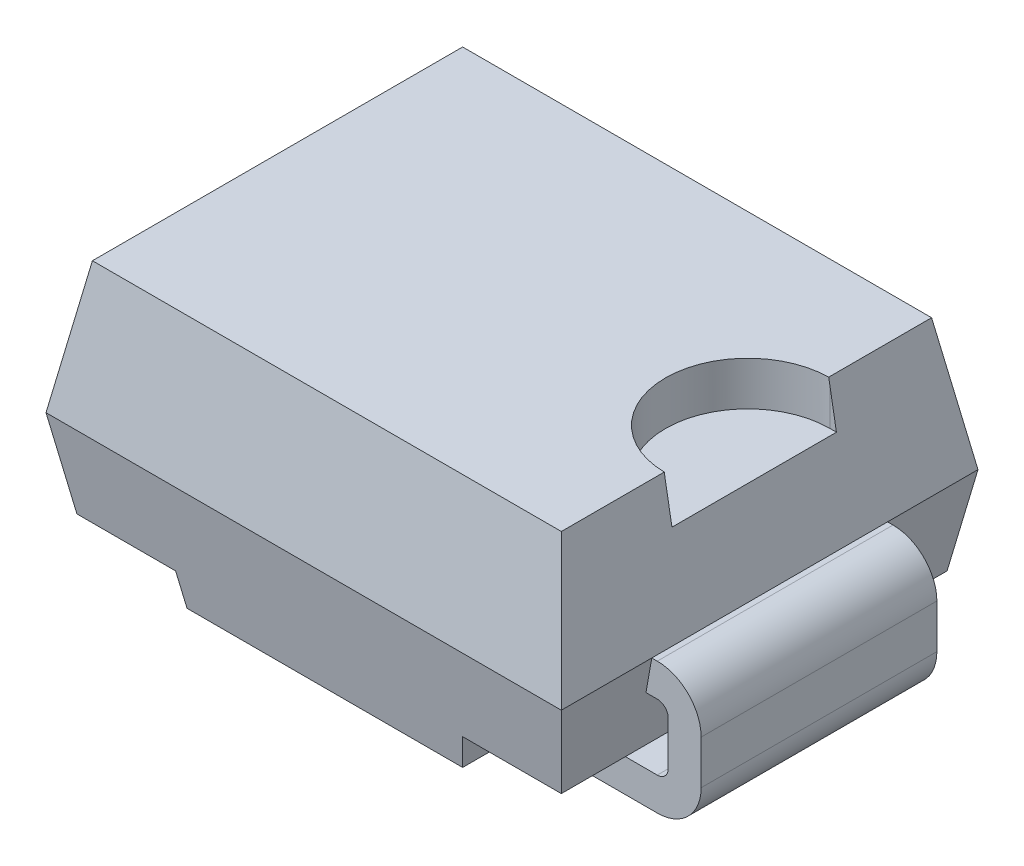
from build123d import *

# Parameters (mm, degrees)
EXTRUDE_START            = -1.075
EXTRUDE_1_DEPTH          = 2.15
EXTRUDE_3_DEPTH          = 1.9
CUT_EXTRUDE_1_DEPTH      = 5.148493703
CUT_EXTRUDE_1_DEPTH_BACK = 5.148493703
SKETCH_4_OUTSIDE_W       = 7.236
SKETCH_4_OUTSIDE_H       = 5.836
CUT_EXTRUDE_2_DEPTH      = 0.4


with BuildPart() as part:
    # Sketch 1 → Extrude 1 (new body)
    with BuildSketch(Plane.XY.offset(EXTRUDE_START)):
        with BuildLine():
            Line((-1.5, 0.3), (-2.4, 0.3))
            ThreePointArc((-2.4, 0.3), (-2.470710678, 0.329289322), (-2.5, 0.4))
            Line((-2.5, 0.4), (-2.5, 0.8))
            ThreePointArc((-2.5, 0.8), (-2.470710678, 0.870710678), (-2.4, 0.9))
            Line((-2.4, 0.9), (2.4, 0.9))
            ThreePointArc((2.4, 0.9), (2.470710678, 0.870710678), (2.5, 0.8))
            Line((2.5, 0.8), (2.5, 0.4))
            ThreePointArc((2.5, 0.4), (2.470710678, 0.329289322), (2.4, 0.3))
            Line((2.4, 0.3), (1.5, 0.3))
            Line((1.5, 0.3), (1.5, 0))
            Line((1.5, 0), (2.4, 0))
            ThreePointArc((2.4, 0), (2.682842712, 0.117157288), (2.8, 0.4))
            Line((2.8, 0.4), (2.8, 0.8))
            ThreePointArc((2.8, 0.8), (2.682842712, 1.082842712), (2.4, 1.2))
            Line((2.4, 1.2), (-2.4, 1.2))
            ThreePointArc((-2.4, 1.2), (-2.682842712, 1.082842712), (-2.8, 0.8))
            Line((-2.8, 0.8), (-2.8, 0.4))
            ThreePointArc((-2.8, 0.4), (-2.682842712, 0.117157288), (-2.4, 0))
            Line((-2.4, 0), (-1.5, 0))
            Line((-1.5, 0), (-1.5, 0.3))
        make_face()
    extrude(amount=EXTRUDE_1_DEPTH)

    # Sketch 3 → Extrude 3 (add, symmetric)
    with BuildSketch(Plane.XY):
        Polygon((2.138407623, 2.4), (-2.138407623, 2.4), (-2.35, 1.2), (-2.208938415, 0.4), (-1.308938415, 0.4), (-1.256843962, 0.104557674), (1.256843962, 0.104557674), (1.308938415, 0.4), (2.208938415, 0.4), (2.35, 1.2), align=None)
    extrude(amount=EXTRUDE_3_DEPTH, both=True)

    # Sketch 4 outside → Cut-Extrude 1 (cut, two sides: drawn at the far end of the back side and taken through both)
    with BuildSketch(Plane(origin=(0, 0, 0), x_dir=(0, 0, -1), z_dir=(1, 0, 0)).offset(-CUT_EXTRUDE_1_DEPTH_BACK)):
        with Locations((0, 1.2)):
            Rectangle(SKETCH_4_OUTSIDE_W, SKETCH_4_OUTSIDE_H)
        Polygon((1.9, 1.2), (1.688407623, 2.4), (-1.688407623, 2.4), (-1.9, 1.2), (-1.688407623, 0), (1.688407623, 0), align=None, mode=Mode.SUBTRACT)
    extrude(amount=CUT_EXTRUDE_1_DEPTH + CUT_EXTRUDE_1_DEPTH_BACK, mode=Mode.SUBTRACT)

    # Sketch 5 → Cut-Extrude 2 (cut)
    with BuildSketch(Plane(origin=(0, 2.4, 0), x_dir=(-1, 0, 0), z_dir=(0, 1, 0))):
        with BuildLine():
            Line((-2.35, -0.75), (-2.15, -0.75))
            ThreePointArc((-2.15, -0.75), (-1.4, 0), (-2.15, 0.75))
            Line((-2.15, 0.75), (-2.35, 0.75))
            Line((-2.35, 0.75), (-2.35, -0.75))
        make_face()
    extrude(amount=-CUT_EXTRUDE_2_DEPTH, mode=Mode.SUBTRACT)


solid = part.part
